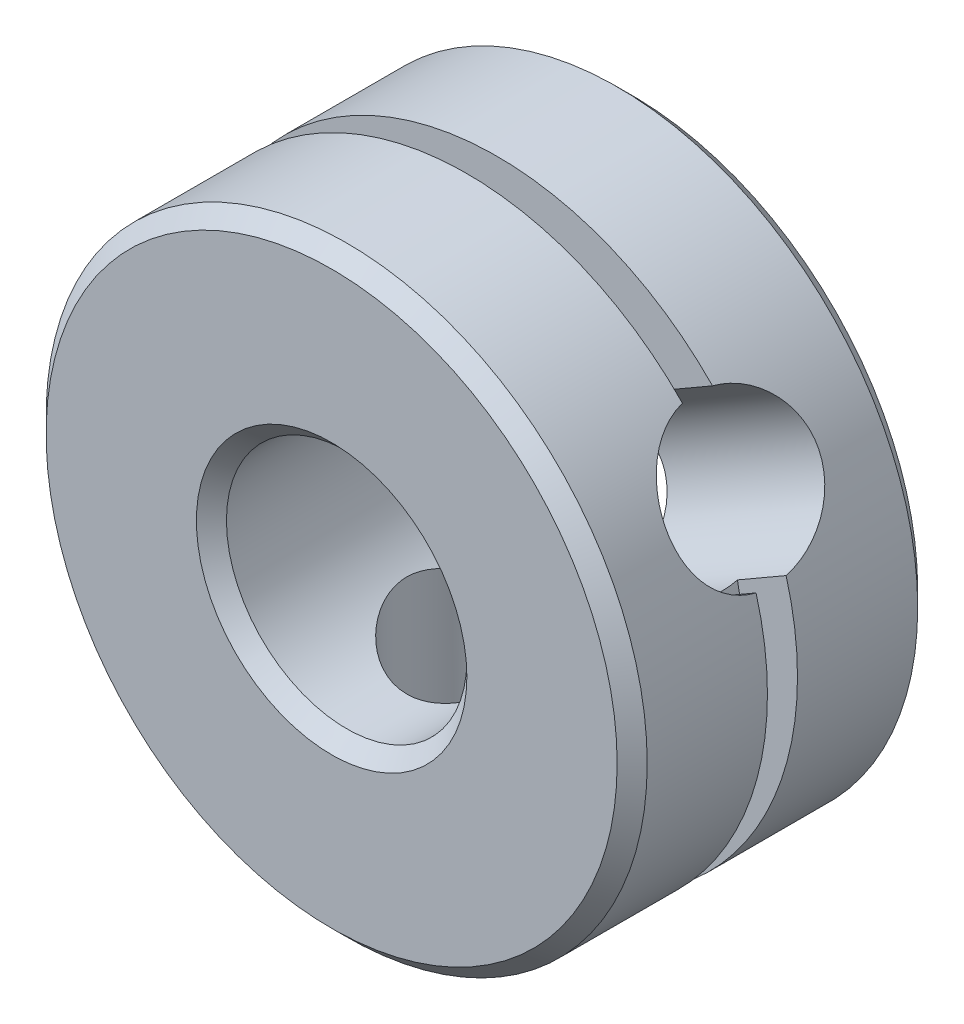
from build123d import *

# Parameters (mm, degrees)
SKETCH1_R          = 10
SKETCH1_R_2        = 4
BASE_EXTRUDE_DEPTH = 10
CHAMFER1_SIZE      = 0.5
SKETCH2_R          = 2.5
HOLE_DEPTH         = 18.320508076
HOLEPAT_COUNT      = 2
HOLEPAT_ANGLE      = 120
ENDCHAMFER_SIZE    = 0.5
SKETCH3_W          = 1.8
SKETCH3_H          = 1


with BuildPart() as part:
    # Sketch1 → Base-Extrude (new body)
    with BuildSketch(Plane.XY):
        Circle(SKETCH1_R)
        Circle(SKETCH1_R_2, mode=Mode.SUBTRACT)
    extrude(amount=-BASE_EXTRUDE_DEPTH)

    # Chamfer1
    chamfer1_edges = [part.edges().sort_by_distance(p)[0] for p in [
        (-10, 0, 0),
        (-10, 0, -10),
    ]]
    chamfer(chamfer1_edges, length=CHAMFER1_SIZE)

    # Sketch2 → Hole (cut, through all)
    with BuildSketch(Plane(origin=(0, 0, 0), x_dir=(1, 0, 0), z_dir=(0, 1, 0))):
        with Locations(Location((0, 5, 0), (0, 0, 270))):
            Circle(SKETCH2_R)
    hole = extrude(amount=-HOLE_DEPTH, mode=Mode.SUBTRACT)

    # HolePat: Hole ×2 about axis
    holepat_axis = Axis((0, 0, -10), (0, 0, 1))
    for i in range(1, HOLEPAT_COUNT):
        add(hole.rotate(holepat_axis, i * HOLEPAT_ANGLE / (HOLEPAT_COUNT - 1)), mode=Mode.SUBTRACT)

    # EndChamfer
    endchamfer_edges = [part.edges().sort_by_distance(p)[0] for p in [
        (-4, 0, -10),
        (-4, 0, 0),
    ]]
    chamfer(endchamfer_edges, length=ENDCHAMFER_SIZE)

    # Sketch3 → Slot (revolve, cut)
    with BuildSketch(Plane(origin=(0, 0, 0), x_dir=(1, 0, 0), z_dir=(0, 1, 0)), mode=Mode.PRIVATE) as slot_sk:
        with Locations((-9.1, 5)):
            Rectangle(SKETCH3_W, SKETCH3_H)
    revolve(slot_sk.sketch.rotate(Axis((0, 0, -2.359307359), (0, 0, 1)), 180), axis=Axis((0, 0, -2.359307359), (0, 0, 1)), mode=Mode.SUBTRACT)


solid = part.part
